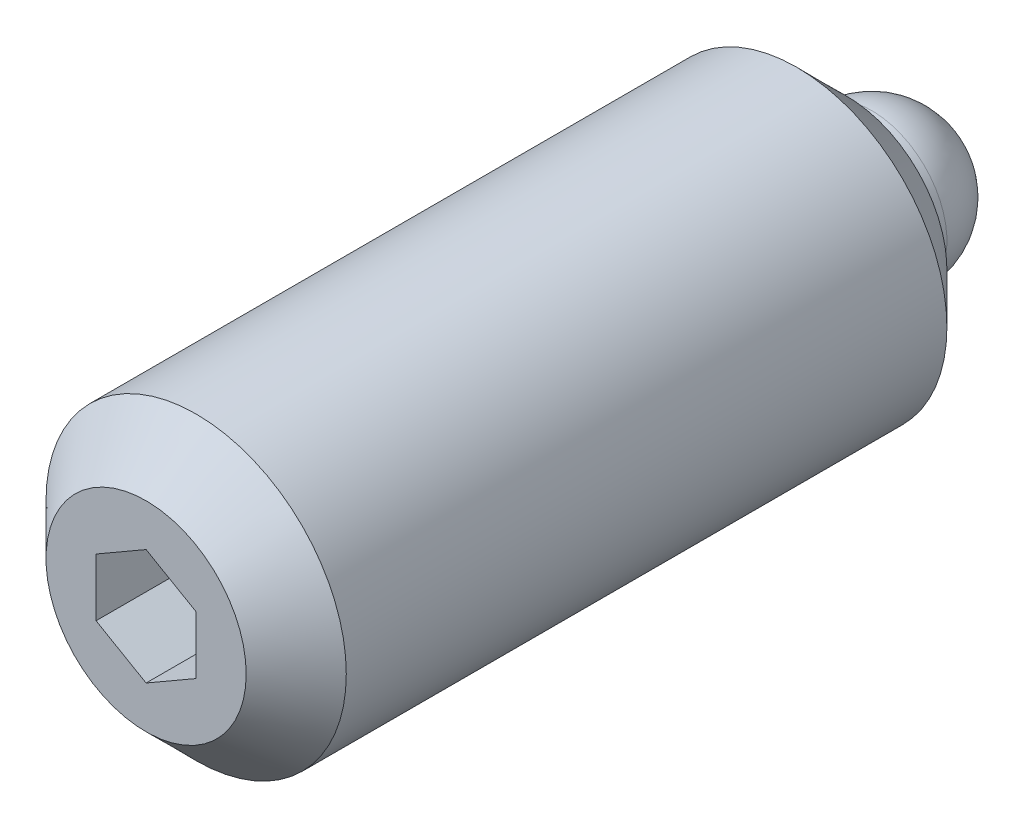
ISO-10303-21;
HEADER;
FILE_DESCRIPTION(('STEP AP214'),'2;1');
FILE_NAME('part.step','',(''),(''),'','','');
FILE_SCHEMA(('AUTOMOTIVE_DESIGN { 1 0 10303 214 1 1 1 1 }'));
ENDSEC;
DATA;
#1=APPLICATION_CONTEXT('core data for automotive mechanical design processes');
#2=APPLICATION_PROTOCOL_DEFINITION('international standard','automotive_design',2000,#1);
#3=PRODUCT_CONTEXT('',#1,'mechanical');
#4=PRODUCT('Part','Part','',(#3));
#5=PRODUCT_RELATED_PRODUCT_CATEGORY('part','',(#4));
#6=PRODUCT_DEFINITION_FORMATION('','',#4);
#7=PRODUCT_DEFINITION_CONTEXT('part definition',#1,'design');
#8=PRODUCT_DEFINITION('design','',#6,#7);
#9=PRODUCT_DEFINITION_SHAPE('','',#8);
#10=(LENGTH_UNIT() NAMED_UNIT(*) SI_UNIT(.MILLI.,.METRE.));
#11=(NAMED_UNIT(*) PLANE_ANGLE_UNIT() SI_UNIT($,.RADIAN.));
#12=(NAMED_UNIT(*) SI_UNIT($,.STERADIAN.) SOLID_ANGLE_UNIT());
#13=UNCERTAINTY_MEASURE_WITH_UNIT(LENGTH_MEASURE(1.E-05),#10,'distance_accuracy_value','');
#14=(GEOMETRIC_REPRESENTATION_CONTEXT(3) GLOBAL_UNCERTAINTY_ASSIGNED_CONTEXT((#13)) GLOBAL_UNIT_ASSIGNED_CONTEXT((#10,
#11,#12)) REPRESENTATION_CONTEXT('',''));
#15=CARTESIAN_POINT('',(0.,0.,0.));
#16=DIRECTION('',(0.,0.,1.));
#17=DIRECTION('',(1.,0.,0.));
#18=AXIS2_PLACEMENT_3D('',#15,#16,#17);
#19=CARTESIAN_POINT('',(0.,6.,32.));
#20=DIRECTION('',(0.,0.,1.));
#21=DIRECTION('',(1.,0.,0.));
#22=AXIS2_PLACEMENT_3D('',#19,#20,#21);
#23=PLANE('',#22);
#24=CARTESIAN_POINT('',(0.,0.,32.));
#25=DIRECTION('',(0.,0.,1.));
#26=DIRECTION('',(1.,0.,0.));
#27=AXIS2_PLACEMENT_3D('',#24,#25,#26);
#28=CIRCLE('',#27,4.);
#29=CARTESIAN_POINT('',(4.,0.,32.));
#30=VERTEX_POINT('',#29);
#31=EDGE_CURVE('E9',#30,#30,#28,.T.);
#32=ORIENTED_EDGE('',*,*,#31,.T.);
#33=EDGE_LOOP('',(#32));
#34=FACE_BOUND('',#33,.T.);
#35=DIRECTION('',(0.866025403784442,-0.499999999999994,0.));
#36=VECTOR('',#35,1.);
#37=CARTESIAN_POINT('',(-2.,-1.15470053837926,32.));
#38=LINE('',#37,#36);
#39=CARTESIAN_POINT('',(-2.,-1.15470053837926,32.));
#40=VERTEX_POINT('',#39);
#41=CARTESIAN_POINT('',(0.,-2.30940107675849,32.));
#42=VERTEX_POINT('',#41);
#43=EDGE_CURVE('E84',#40,#42,#38,.T.);
#44=ORIENTED_EDGE('',*,*,#43,.F.);
#45=DIRECTION('',(0.,1.,0.));
#46=VECTOR('',#45,1.);
#47=CARTESIAN_POINT('',(-2.,-1.15470053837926,32.));
#48=LINE('',#47,#46);
#49=CARTESIAN_POINT('',(-2.,1.15470053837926,32.));
#50=VERTEX_POINT('',#49);
#51=EDGE_CURVE('E29',#40,#50,#48,.T.);
#52=ORIENTED_EDGE('',*,*,#51,.T.);
#53=DIRECTION('',(0.866025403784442,0.499999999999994,0.));
#54=VECTOR('',#53,1.);
#55=CARTESIAN_POINT('',(-2.,1.15470053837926,32.));
#56=LINE('',#55,#54);
#57=CARTESIAN_POINT('',(0.,2.30940107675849,32.));
#58=VERTEX_POINT('',#57);
#59=EDGE_CURVE('E74',#50,#58,#56,.T.);
#60=ORIENTED_EDGE('',*,*,#59,.T.);
#61=DIRECTION('',(-0.866025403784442,0.499999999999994,0.));
#62=VECTOR('',#61,1.);
#63=CARTESIAN_POINT('',(2.,1.15470053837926,32.));
#64=LINE('',#63,#62);
#65=CARTESIAN_POINT('',(2.,1.15470053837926,32.));
#66=VERTEX_POINT('',#65);
#67=EDGE_CURVE('E79',#66,#58,#64,.T.);
#68=ORIENTED_EDGE('',*,*,#67,.F.);
#69=DIRECTION('',(0.,1.,0.));
#70=VECTOR('',#69,1.);
#71=CARTESIAN_POINT('',(2.,-1.15470053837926,32.));
#72=LINE('',#71,#70);
#73=CARTESIAN_POINT('',(2.,-1.15470053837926,32.));
#74=VERTEX_POINT('',#73);
#75=EDGE_CURVE('E88',#74,#66,#72,.T.);
#76=ORIENTED_EDGE('',*,*,#75,.F.);
#77=DIRECTION('',(-0.866025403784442,-0.499999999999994,0.));
#78=VECTOR('',#77,1.);
#79=CARTESIAN_POINT('',(2.,-1.15470053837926,32.));
#80=LINE('',#79,#78);
#81=EDGE_CURVE('E91',#74,#42,#80,.T.);
#82=ORIENTED_EDGE('',*,*,#81,.T.);
#83=EDGE_LOOP('',(#44,#52,#60,#68,#76,#82));
#84=FACE_BOUND('',#83,.T.);
#85=ADVANCED_FACE('F14',(#34,#84),#23,.T.);
#86=CARTESIAN_POINT('',(0.,0.,3.));
#87=DIRECTION('',(-1.,0.,0.));
#88=DIRECTION('',(0.,0.,1.));
#89=AXIS2_PLACEMENT_3D('',#86,#87,#88);
#90=SPHERICAL_SURFACE('',#89,3.);
#91=CARTESIAN_POINT('',(0.,0.,3.));
#92=DIRECTION('',(0.,0.,-1.));
#93=DIRECTION('',(-1.,0.,0.));
#94=AXIS2_PLACEMENT_3D('',#91,#92,#93);
#95=SPHERICAL_SURFACE('',#94,3.);
#96=CARTESIAN_POINT('',(0.,0.,3.));
#97=DIRECTION('',(0.,0.,-1.));
#98=DIRECTION('',(-1.,0.,0.));
#99=AXIS2_PLACEMENT_3D('',#96,#97,#98);
#100=CIRCLE('',#99,3.);
#101=CARTESIAN_POINT('',(-3.,0.,3.));
#102=VERTEX_POINT('',#101);
#103=EDGE_CURVE('E70',#102,#102,#100,.T.);
#104=ORIENTED_EDGE('',*,*,#103,.T.);
#105=EDGE_LOOP('',(#104));
#106=FACE_BOUND('',#105,.T.);
#107=ADVANCED_FACE('F152',(#106),#95,.T.);
#108=CARTESIAN_POINT('',(0.,0.,-5.));
#109=DIRECTION('',(0.,0.,-1.));
#110=DIRECTION('',(-1.,0.,0.));
#111=AXIS2_PLACEMENT_3D('',#108,#109,#110);
#112=CYLINDRICAL_SURFACE('',#111,6.);
#113=CARTESIAN_POINT('',(0.,0.,6.));
#114=DIRECTION('',(0.,0.,-1.));
#115=DIRECTION('',(-1.,0.,0.));
#116=AXIS2_PLACEMENT_3D('',#113,#114,#115);
#117=CIRCLE('',#116,6.);
#118=CARTESIAN_POINT('',(-6.,0.,6.));
#119=VERTEX_POINT('',#118);
#120=EDGE_CURVE('E22',#119,#119,#117,.F.);
#121=ORIENTED_EDGE('',*,*,#120,.T.);
#122=EDGE_LOOP('',(#121));
#123=FACE_BOUND('',#122,.T.);
#124=CARTESIAN_POINT('',(0.,0.,30.));
#125=DIRECTION('',(0.,0.,1.));
#126=DIRECTION('',(1.,0.,0.));
#127=AXIS2_PLACEMENT_3D('',#124,#125,#126);
#128=CIRCLE('',#127,6.);
#129=CARTESIAN_POINT('',(6.,0.,30.));
#130=VERTEX_POINT('',#129);
#131=EDGE_CURVE('E125',#130,#130,#128,.F.);
#132=ORIENTED_EDGE('',*,*,#131,.T.);
#133=EDGE_LOOP('',(#132));
#134=FACE_BOUND('',#133,.T.);
#135=ADVANCED_FACE('F130',(#123,#134),#112,.T.);
#136=CARTESIAN_POINT('',(0.,3.,4.));
#137=DIRECTION('',(0.,0.,-1.));
#138=DIRECTION('',(-1.,0.,0.));
#139=AXIS2_PLACEMENT_3D('',#136,#137,#138);
#140=PLANE('',#139);
#141=CARTESIAN_POINT('',(0.,0.,4.));
#142=DIRECTION('',(0.,0.,-1.));
#143=DIRECTION('',(-1.,0.,0.));
#144=AXIS2_PLACEMENT_3D('',#141,#142,#143);
#145=CIRCLE('',#144,4.);
#146=CARTESIAN_POINT('',(-4.,0.,4.));
#147=VERTEX_POINT('',#146);
#148=EDGE_CURVE('E122',#147,#147,#145,.T.);
#149=ORIENTED_EDGE('',*,*,#148,.T.);
#150=EDGE_LOOP('',(#149));
#151=FACE_BOUND('',#150,.T.);
#152=CARTESIAN_POINT('',(0.,0.,4.));
#153=DIRECTION('',(0.,0.,-1.));
#154=DIRECTION('',(-1.,0.,0.));
#155=AXIS2_PLACEMENT_3D('',#152,#153,#154);
#156=CIRCLE('',#155,3.);
#157=CARTESIAN_POINT('',(-3.,0.,4.));
#158=VERTEX_POINT('',#157);
#159=EDGE_CURVE('E119',#158,#158,#156,.T.);
#160=ORIENTED_EDGE('',*,*,#159,.F.);
#161=EDGE_LOOP('',(#160));
#162=FACE_BOUND('',#161,.T.);
#163=ADVANCED_FACE('F140',(#151,#162),#140,.T.);
#164=CARTESIAN_POINT('',(0.,0.,-5.));
#165=DIRECTION('',(0.,0.,-1.));
#166=DIRECTION('',(-1.,0.,0.));
#167=AXIS2_PLACEMENT_3D('',#164,#165,#166);
#168=CYLINDRICAL_SURFACE('',#167,3.);
#169=ORIENTED_EDGE('',*,*,#159,.T.);
#170=EDGE_LOOP('',(#169));
#171=FACE_BOUND('',#170,.T.);
#172=ORIENTED_EDGE('',*,*,#103,.F.);
#173=EDGE_LOOP('',(#172));
#174=FACE_BOUND('',#173,.T.);
#175=ADVANCED_FACE('F143',(#171,#174),#168,.T.);
#176=CARTESIAN_POINT('',(-2.,-1.15470053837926,27.));
#177=DIRECTION('',(1.,0.,0.));
#178=DIRECTION('',(0.,0.,-1.));
#179=AXIS2_PLACEMENT_3D('',#176,#177,#178);
#180=PLANE('',#179);
#181=DIRECTION('',(0.,0.,1.));
#182=VECTOR('',#181,1.);
#183=CARTESIAN_POINT('',(-2.,1.15470053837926,27.));
#184=LINE('',#183,#182);
#185=CARTESIAN_POINT('',(-2.,1.15470053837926,27.));
#186=VERTEX_POINT('',#185);
#187=EDGE_CURVE('E63',#186,#50,#184,.T.);
#188=ORIENTED_EDGE('',*,*,#187,.T.);
#189=ORIENTED_EDGE('',*,*,#51,.F.);
#190=DIRECTION('',(0.,0.,1.));
#191=VECTOR('',#190,1.);
#192=CARTESIAN_POINT('',(-2.,-1.15470053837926,27.));
#193=LINE('',#192,#191);
#194=CARTESIAN_POINT('',(-2.,-1.15470053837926,27.));
#195=VERTEX_POINT('',#194);
#196=EDGE_CURVE('E33',#195,#40,#193,.T.);
#197=ORIENTED_EDGE('',*,*,#196,.F.);
#198=DIRECTION('',(0.,1.,0.));
#199=VECTOR('',#198,1.);
#200=CARTESIAN_POINT('',(-2.,-1.15470053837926,27.));
#201=LINE('',#200,#199);
#202=EDGE_CURVE('E66',#195,#186,#201,.T.);
#203=ORIENTED_EDGE('',*,*,#202,.T.);
#204=EDGE_LOOP('',(#188,#189,#197,#203));
#205=FACE_BOUND('',#204,.T.);
#206=ADVANCED_FACE('F65',(#205),#180,.T.);
#207=CARTESIAN_POINT('',(-2.,1.15470053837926,27.));
#208=DIRECTION('',(0.499999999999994,-0.866025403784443,0.));
#209=DIRECTION('',(0.866025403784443,0.499999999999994,0.));
#210=AXIS2_PLACEMENT_3D('',#207,#208,#209);
#211=PLANE('',#210);
#212=DIRECTION('',(0.,0.,1.));
#213=VECTOR('',#212,1.);
#214=CARTESIAN_POINT('',(0.,2.30940107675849,27.));
#215=LINE('',#214,#213);
#216=CARTESIAN_POINT('',(0.,2.30940107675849,27.));
#217=VERTEX_POINT('',#216);
#218=EDGE_CURVE('E71',#217,#58,#215,.T.);
#219=ORIENTED_EDGE('',*,*,#218,.T.);
#220=ORIENTED_EDGE('',*,*,#59,.F.);
#221=ORIENTED_EDGE('',*,*,#187,.F.);
#222=DIRECTION('',(0.866025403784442,0.499999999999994,0.));
#223=VECTOR('',#222,1.);
#224=CARTESIAN_POINT('',(-2.,1.15470053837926,27.));
#225=LINE('',#224,#223);
#226=EDGE_CURVE('E95',#186,#217,#225,.T.);
#227=ORIENTED_EDGE('',*,*,#226,.T.);
#228=EDGE_LOOP('',(#219,#220,#221,#227));
#229=FACE_BOUND('',#228,.T.);
#230=ADVANCED_FACE('F75',(#229),#211,.T.);
#231=CARTESIAN_POINT('',(2.,1.15470053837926,27.));
#232=DIRECTION('',(0.499999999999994,0.866025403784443,0.));
#233=DIRECTION('',(-0.866025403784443,0.499999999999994,0.));
#234=AXIS2_PLACEMENT_3D('',#231,#232,#233);
#235=PLANE('',#234);
#236=DIRECTION('',(0.,0.,1.));
#237=VECTOR('',#236,1.);
#238=CARTESIAN_POINT('',(2.,1.15470053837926,27.));
#239=LINE('',#238,#237);
#240=CARTESIAN_POINT('',(2.,1.15470053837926,27.));
#241=VERTEX_POINT('',#240);
#242=EDGE_CURVE('E114',#241,#66,#239,.T.);
#243=ORIENTED_EDGE('',*,*,#242,.T.);
#244=ORIENTED_EDGE('',*,*,#67,.T.);
#245=ORIENTED_EDGE('',*,*,#218,.F.);
#246=DIRECTION('',(-0.866025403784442,0.499999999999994,0.));
#247=VECTOR('',#246,1.);
#248=CARTESIAN_POINT('',(2.,1.15470053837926,27.));
#249=LINE('',#248,#247);
#250=EDGE_CURVE('E97',#241,#217,#249,.T.);
#251=ORIENTED_EDGE('',*,*,#250,.F.);
#252=EDGE_LOOP('',(#243,#244,#245,#251));
#253=FACE_BOUND('',#252,.T.);
#254=ADVANCED_FACE('F166',(#253),#235,.F.);
#255=CARTESIAN_POINT('',(2.,-1.15470053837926,27.));
#256=DIRECTION('',(1.,0.,0.));
#257=DIRECTION('',(0.,0.,-1.));
#258=AXIS2_PLACEMENT_3D('',#255,#256,#257);
#259=PLANE('',#258);
#260=DIRECTION('',(0.,0.,1.));
#261=VECTOR('',#260,1.);
#262=CARTESIAN_POINT('',(2.,-1.15470053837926,27.));
#263=LINE('',#262,#261);
#264=CARTESIAN_POINT('',(2.,-1.15470053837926,27.));
#265=VERTEX_POINT('',#264);
#266=EDGE_CURVE('E112',#265,#74,#263,.T.);
#267=ORIENTED_EDGE('',*,*,#266,.T.);
#268=ORIENTED_EDGE('',*,*,#75,.T.);
#269=ORIENTED_EDGE('',*,*,#242,.F.);
#270=DIRECTION('',(0.,1.,0.));
#271=VECTOR('',#270,1.);
#272=CARTESIAN_POINT('',(2.,-1.15470053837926,27.));
#273=LINE('',#272,#271);
#274=EDGE_CURVE('E100',#265,#241,#273,.T.);
#275=ORIENTED_EDGE('',*,*,#274,.F.);
#276=EDGE_LOOP('',(#267,#268,#269,#275));
#277=FACE_BOUND('',#276,.T.);
#278=ADVANCED_FACE('F169',(#277),#259,.F.);
#279=CARTESIAN_POINT('',(2.,-1.15470053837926,27.));
#280=DIRECTION('',(-0.499999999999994,0.866025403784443,0.));
#281=DIRECTION('',(-0.866025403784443,-0.499999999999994,0.));
#282=AXIS2_PLACEMENT_3D('',#279,#280,#281);
#283=PLANE('',#282);
#284=DIRECTION('',(0.,0.,1.));
#285=VECTOR('',#284,1.);
#286=CARTESIAN_POINT('',(0.,-2.30940107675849,27.));
#287=LINE('',#286,#285);
#288=CARTESIAN_POINT('',(0.,-2.30940107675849,27.));
#289=VERTEX_POINT('',#288);
#290=EDGE_CURVE('E110',#289,#42,#287,.T.);
#291=ORIENTED_EDGE('',*,*,#290,.T.);
#292=ORIENTED_EDGE('',*,*,#81,.F.);
#293=ORIENTED_EDGE('',*,*,#266,.F.);
#294=DIRECTION('',(-0.866025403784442,-0.499999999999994,0.));
#295=VECTOR('',#294,1.);
#296=CARTESIAN_POINT('',(2.,-1.15470053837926,27.));
#297=LINE('',#296,#295);
#298=EDGE_CURVE('E103',#265,#289,#297,.T.);
#299=ORIENTED_EDGE('',*,*,#298,.T.);
#300=EDGE_LOOP('',(#291,#292,#293,#299));
#301=FACE_BOUND('',#300,.T.);
#302=ADVANCED_FACE('F173',(#301),#283,.T.);
#303=CARTESIAN_POINT('',(-2.,-1.15470053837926,27.));
#304=DIRECTION('',(-0.499999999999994,-0.866025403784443,0.));
#305=DIRECTION('',(0.866025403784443,-0.499999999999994,0.));
#306=AXIS2_PLACEMENT_3D('',#303,#304,#305);
#307=PLANE('',#306);
#308=DIRECTION('',(0.866025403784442,-0.499999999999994,0.));
#309=VECTOR('',#308,1.);
#310=CARTESIAN_POINT('',(-2.,-1.15470053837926,27.));
#311=LINE('',#310,#309);
#312=EDGE_CURVE('E106',#195,#289,#311,.T.);
#313=ORIENTED_EDGE('',*,*,#312,.F.);
#314=ORIENTED_EDGE('',*,*,#196,.T.);
#315=ORIENTED_EDGE('',*,*,#43,.T.);
#316=ORIENTED_EDGE('',*,*,#290,.F.);
#317=EDGE_LOOP('',(#313,#314,#315,#316));
#318=FACE_BOUND('',#317,.T.);
#319=ADVANCED_FACE('F137',(#318),#307,.F.);
#320=CARTESIAN_POINT('',(-2.,1.15470053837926,27.));
#321=DIRECTION('',(0.,0.,-1.));
#322=DIRECTION('',(-1.,0.,0.));
#323=AXIS2_PLACEMENT_3D('',#320,#321,#322);
#324=PLANE('',#323);
#325=ORIENTED_EDGE('',*,*,#202,.F.);
#326=ORIENTED_EDGE('',*,*,#312,.T.);
#327=ORIENTED_EDGE('',*,*,#298,.F.);
#328=ORIENTED_EDGE('',*,*,#274,.T.);
#329=ORIENTED_EDGE('',*,*,#250,.T.);
#330=ORIENTED_EDGE('',*,*,#226,.F.);
#331=EDGE_LOOP('',(#325,#326,#327,#328,#329,#330));
#332=FACE_BOUND('',#331,.T.);
#333=ADVANCED_FACE('F136',(#332),#324,.F.);
#334=CARTESIAN_POINT('',(0.,0.,4.));
#335=DIRECTION('',(0.,0.,1.));
#336=DIRECTION('',(1.,0.,0.));
#337=AXIS2_PLACEMENT_3D('',#334,#335,#336);
#338=CONICAL_SURFACE('',#337,4.,0.785398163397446);
#339=ORIENTED_EDGE('',*,*,#120,.F.);
#340=EDGE_LOOP('',(#339));
#341=FACE_BOUND('',#340,.T.);
#342=ORIENTED_EDGE('',*,*,#148,.F.);
#343=EDGE_LOOP('',(#342));
#344=FACE_BOUND('',#343,.T.);
#345=ADVANCED_FACE('F133',(#341,#344),#338,.T.);
#346=CARTESIAN_POINT('',(0.,0.,30.));
#347=DIRECTION('',(0.,0.,-1.));
#348=DIRECTION('',(-1.,0.,0.));
#349=AXIS2_PLACEMENT_3D('',#346,#347,#348);
#350=CONICAL_SURFACE('',#349,6.,0.78539816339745);
#351=ORIENTED_EDGE('',*,*,#31,.F.);
#352=EDGE_LOOP('',(#351));
#353=FACE_BOUND('',#352,.T.);
#354=ORIENTED_EDGE('',*,*,#131,.F.);
#355=EDGE_LOOP('',(#354));
#356=FACE_BOUND('',#355,.T.);
#357=ADVANCED_FACE('F16',(#353,#356),#350,.T.);
#358=CLOSED_SHELL('',(#85,#107,#135,#163,#175,#206,#230,#254,#278,#302,#319,#333,#345,#357));
#359=MANIFOLD_SOLID_BREP('B1',#358);
#360=ADVANCED_BREP_SHAPE_REPRESENTATION('',(#18,#359),#14);
#361=SHAPE_DEFINITION_REPRESENTATION(#9,#360);
ENDSEC;
END-ISO-10303-21;
